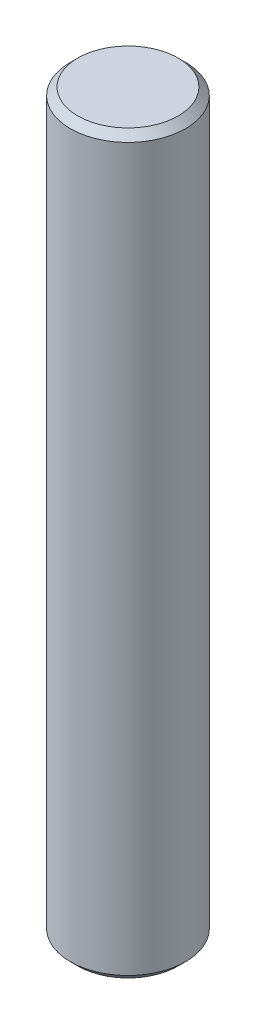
ISO-10303-21;
HEADER;
FILE_DESCRIPTION(('STEP AP214'),'2;1');
FILE_NAME('part.step','',(''),(''),'','','');
FILE_SCHEMA(('AUTOMOTIVE_DESIGN { 1 0 10303 214 1 1 1 1 }'));
ENDSEC;
DATA;
#1=APPLICATION_CONTEXT('core data for automotive mechanical design processes');
#2=APPLICATION_PROTOCOL_DEFINITION('international standard','automotive_design',2000,#1);
#3=PRODUCT_CONTEXT('',#1,'mechanical');
#4=PRODUCT('Part','Part','',(#3));
#5=PRODUCT_RELATED_PRODUCT_CATEGORY('part','',(#4));
#6=PRODUCT_DEFINITION_FORMATION('','',#4);
#7=PRODUCT_DEFINITION_CONTEXT('part definition',#1,'design');
#8=PRODUCT_DEFINITION('design','',#6,#7);
#9=PRODUCT_DEFINITION_SHAPE('','',#8);
#10=(LENGTH_UNIT() NAMED_UNIT(*) SI_UNIT(.MILLI.,.METRE.));
#11=(NAMED_UNIT(*) PLANE_ANGLE_UNIT() SI_UNIT($,.RADIAN.));
#12=(NAMED_UNIT(*) SI_UNIT($,.STERADIAN.) SOLID_ANGLE_UNIT());
#13=UNCERTAINTY_MEASURE_WITH_UNIT(LENGTH_MEASURE(1.E-05),#10,'distance_accuracy_value','');
#14=(GEOMETRIC_REPRESENTATION_CONTEXT(3) GLOBAL_UNCERTAINTY_ASSIGNED_CONTEXT((#13)) GLOBAL_UNIT_ASSIGNED_CONTEXT((#10,
#11,#12)) REPRESENTATION_CONTEXT('',''));
#15=CARTESIAN_POINT('',(0.,0.,0.));
#16=DIRECTION('',(0.,0.,1.));
#17=DIRECTION('',(1.,0.,0.));
#18=AXIS2_PLACEMENT_3D('',#15,#16,#17);
#19=CARTESIAN_POINT('',(0.,25.4,0.));
#20=DIRECTION('',(0.,-1.,0.));
#21=DIRECTION('',(0.,0.,-1.));
#22=AXIS2_PLACEMENT_3D('',#19,#20,#21);
#23=CYLINDRICAL_SURFACE('',#22,3.97129);
#24=CARTESIAN_POINT('',(0.,-24.892,0.));
#25=DIRECTION('',(0.,1.,0.));
#26=DIRECTION('',(0.,0.,1.));
#27=AXIS2_PLACEMENT_3D('',#24,#25,#26);
#28=CIRCLE('',#27,3.97129);
#29=CARTESIAN_POINT('',(0.,-24.892,3.97129));
#30=VERTEX_POINT('',#29);
#31=EDGE_CURVE('E40',#30,#30,#28,.T.);
#32=ORIENTED_EDGE('',*,*,#31,.T.);
#33=EDGE_LOOP('',(#32));
#34=FACE_BOUND('',#33,.T.);
#35=CARTESIAN_POINT('',(0.,24.892,0.));
#36=DIRECTION('',(0.,1.,0.));
#37=DIRECTION('',(0.,0.,1.));
#38=AXIS2_PLACEMENT_3D('',#35,#36,#37);
#39=CIRCLE('',#38,3.97129);
#40=CARTESIAN_POINT('',(0.,24.892,3.97129));
#41=VERTEX_POINT('',#40);
#42=EDGE_CURVE('E44',#41,#41,#39,.F.);
#43=ORIENTED_EDGE('',*,*,#42,.T.);
#44=EDGE_LOOP('',(#43));
#45=FACE_BOUND('',#44,.T.);
#46=ADVANCED_FACE('F29',(#34,#45),#23,.T.);
#47=CARTESIAN_POINT('',(0.,25.4,0.));
#48=DIRECTION('',(0.,1.,0.));
#49=DIRECTION('',(0.,0.,1.));
#50=AXIS2_PLACEMENT_3D('',#47,#48,#49);
#51=PLANE('',#50);
#52=CARTESIAN_POINT('',(0.,25.4,0.));
#53=DIRECTION('',(0.,1.,0.));
#54=DIRECTION('',(0.,0.,1.));
#55=AXIS2_PLACEMENT_3D('',#52,#53,#54);
#56=CIRCLE('',#55,3.46329);
#57=CARTESIAN_POINT('',(0.,25.4,3.46329));
#58=VERTEX_POINT('',#57);
#59=EDGE_CURVE('E10',#58,#58,#56,.T.);
#60=ORIENTED_EDGE('',*,*,#59,.T.);
#61=EDGE_LOOP('',(#60));
#62=FACE_BOUND('',#61,.T.);
#63=ADVANCED_FACE('F60',(#62),#51,.T.);
#64=CARTESIAN_POINT('',(0.,-25.4,0.));
#65=DIRECTION('',(0.,1.,0.));
#66=DIRECTION('',(0.,0.,1.));
#67=AXIS2_PLACEMENT_3D('',#64,#65,#66);
#68=PLANE('',#67);
#69=CARTESIAN_POINT('',(0.,-25.4,0.));
#70=DIRECTION('',(0.,1.,0.));
#71=DIRECTION('',(0.,0.,1.));
#72=AXIS2_PLACEMENT_3D('',#69,#70,#71);
#73=CIRCLE('',#72,3.46328999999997);
#74=CARTESIAN_POINT('',(0.,-25.4,3.46328999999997));
#75=VERTEX_POINT('',#74);
#76=EDGE_CURVE('E36',#75,#75,#73,.F.);
#77=ORIENTED_EDGE('',*,*,#76,.T.);
#78=EDGE_LOOP('',(#77));
#79=FACE_BOUND('',#78,.T.);
#80=ADVANCED_FACE('F57',(#79),#68,.F.);
#81=CARTESIAN_POINT('',(0.,-24.892,0.));
#82=DIRECTION('',(0.,1.,0.));
#83=DIRECTION('',(0.,0.,1.));
#84=AXIS2_PLACEMENT_3D('',#81,#82,#83);
#85=CONICAL_SURFACE('',#84,3.97129,0.785398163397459);
#86=ORIENTED_EDGE('',*,*,#76,.F.);
#87=EDGE_LOOP('',(#86));
#88=FACE_BOUND('',#87,.T.);
#89=ORIENTED_EDGE('',*,*,#31,.F.);
#90=EDGE_LOOP('',(#89));
#91=FACE_BOUND('',#90,.T.);
#92=ADVANCED_FACE('F53',(#88,#91),#85,.T.);
#93=CARTESIAN_POINT('',(0.,25.4,0.));
#94=DIRECTION('',(0.,-1.,0.));
#95=DIRECTION('',(0.,0.,-1.));
#96=AXIS2_PLACEMENT_3D('',#93,#94,#95);
#97=CONICAL_SURFACE('',#96,3.46329,0.785398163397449);
#98=ORIENTED_EDGE('',*,*,#42,.F.);
#99=EDGE_LOOP('',(#98));
#100=FACE_BOUND('',#99,.T.);
#101=ORIENTED_EDGE('',*,*,#59,.F.);
#102=EDGE_LOOP('',(#101));
#103=FACE_BOUND('',#102,.T.);
#104=ADVANCED_FACE('F31',(#100,#103),#97,.T.);
#105=CLOSED_SHELL('',(#46,#63,#80,#92,#104));
#106=MANIFOLD_SOLID_BREP('B2',#105);
#107=ADVANCED_BREP_SHAPE_REPRESENTATION('',(#18,#106),#14);
#108=SHAPE_DEFINITION_REPRESENTATION(#9,#107);
ENDSEC;
END-ISO-10303-21;
